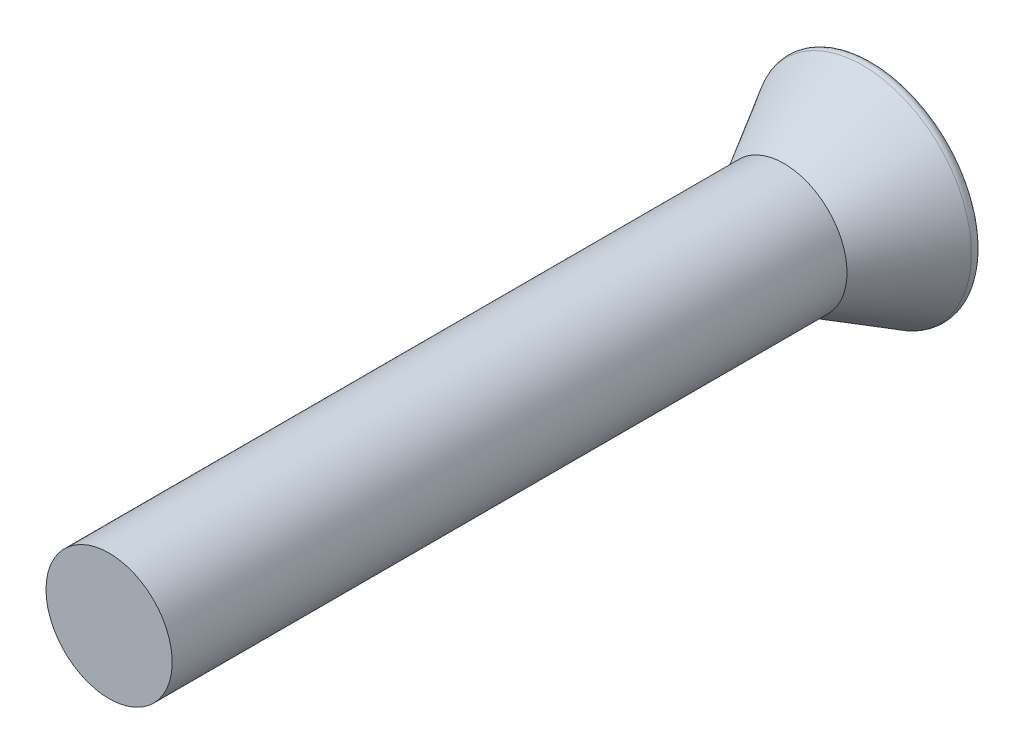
from build123d import *


with BuildPart() as part:
    # Logo3_bib1 → Revolve1 (revolve)
    with BuildSketch(Plane(origin=(0, 0, 0), x_dir=(-1, 0, 0), z_dir=(0, -1, 0))):
        with BuildLine():
            Line((1.355657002, -0.11811), (0.7874, -1.10236))
            Line((0.7874, -1.10236), (0.7874, -9.525))
            Line((0.7874, -9.525), (0, -9.525))
            Line((0, -9.525), (0, 0))
            Line((0, 0), (1.287466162, 0))
            ThreePointArc((1.287466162, 0), (1.355657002, -0.03937), (1.355657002, -0.11811))
        make_face()
    revolve(axis=Axis((0, 0, -16.546754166), (0, 0, 1)))


solid = part.part
